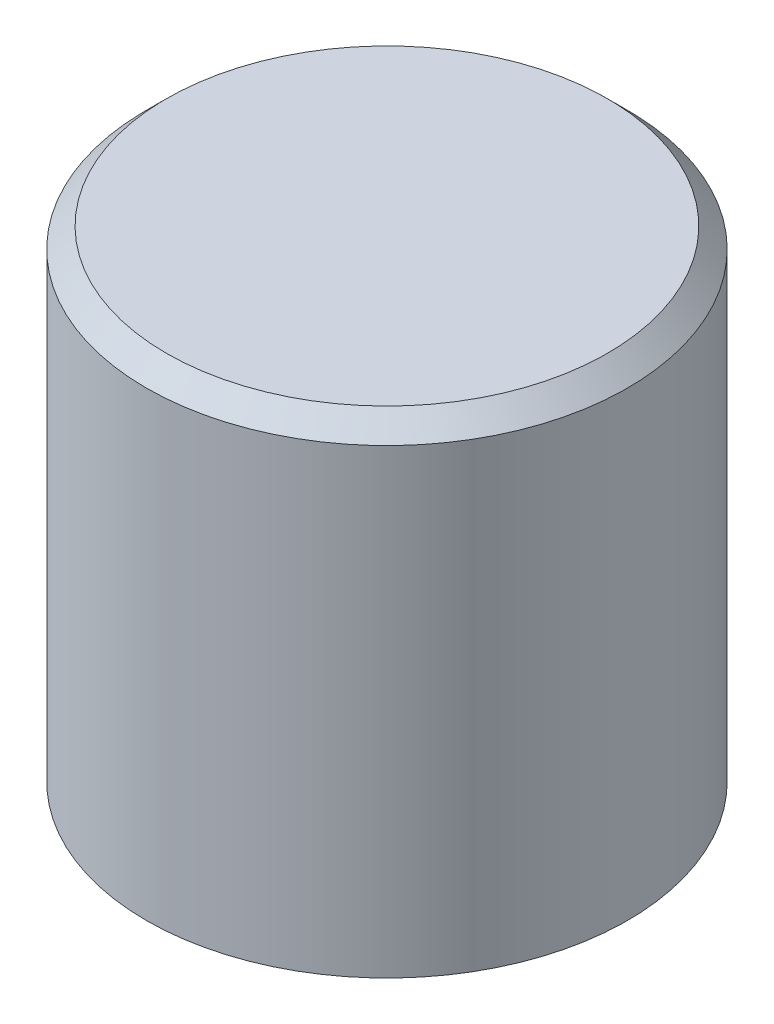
from build123d import *

# Parameters (mm, degrees)
CHAMFER1_SIZE  = 0.5
CHAMFER2_SIZE  = 0.1
CHAMFER2_SIZE2 = 0.123280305


with BuildPart() as part:
    # Sketch1 → Revolve2 (revolve)
    with BuildSketch(Plane.XY, mode=Mode.PRIVATE) as revolve2_sk:
        Polygon((0, 12), (-6, 12), (-6, 0), (-5, 0), (-5, 3), (-1.5, 3.617144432), (-1.5, 8.5), (0, 8.5), align=None)
    revolve(revolve2_sk.sketch.rotate(Axis((0, 0, 0), (0, -1, 0)), 270), axis=Axis((0, 0, 0), (0, -1, 0)))

    # Chamfer1
    chamfer1_edges = [part.edges().sort_by_distance(p)[0] for p in [
        (0, 12, -6),
    ]]
    chamfer(chamfer1_edges, length=CHAMFER1_SIZE)

    # Chamfer2
    chamfer2_edges = [part.edges().sort_by_distance(p)[0] for p in [
        (0, 3.617144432, -1.5),
    ]]
    chamfer2_side = [part.faces().sort_by_distance(p)[0] for p in [
        (0, 6.058572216, -1.5),
    ]]
    chamfer(chamfer2_edges, length=CHAMFER2_SIZE, length2=CHAMFER2_SIZE2, reference=chamfer2_side[0])


solid = part.part
